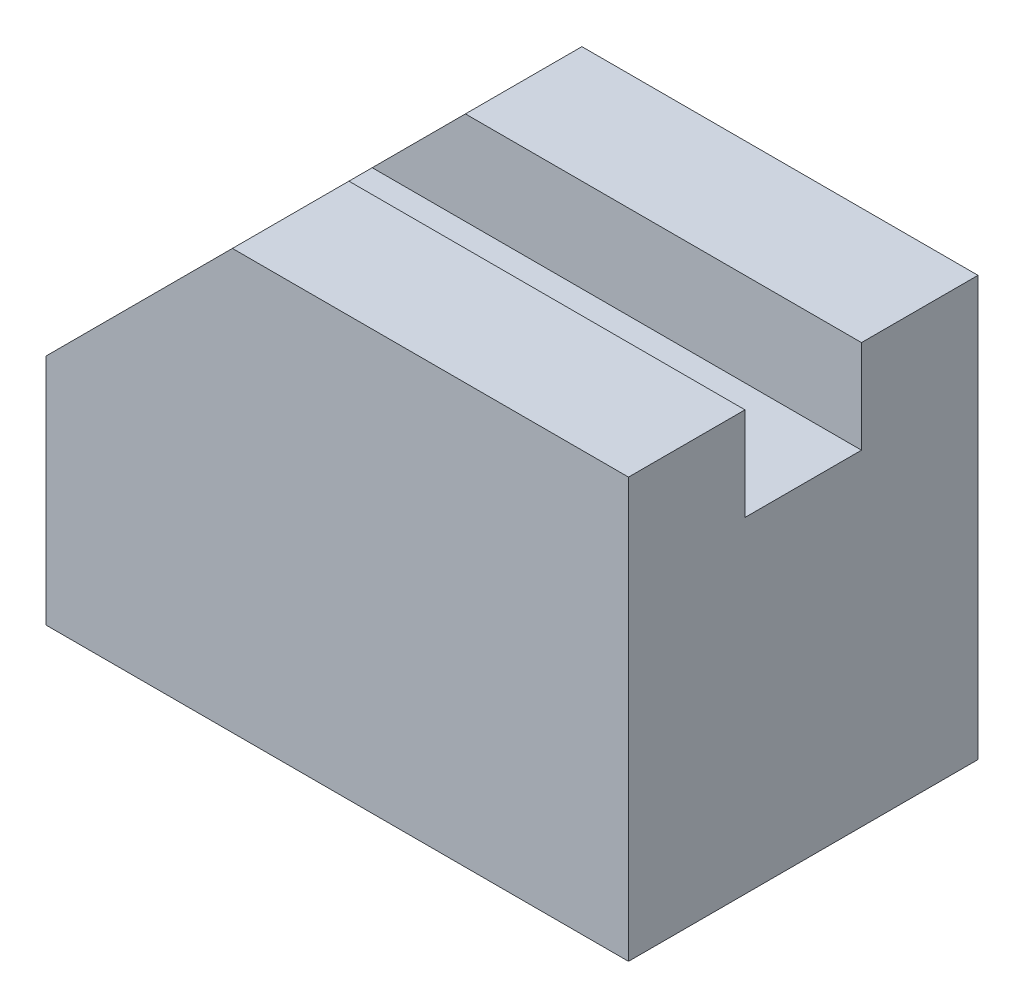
ISO-10303-21;
HEADER;
FILE_DESCRIPTION(('STEP AP214'),'2;1');
FILE_NAME('part.step','',(''),(''),'','','');
FILE_SCHEMA(('AUTOMOTIVE_DESIGN { 1 0 10303 214 1 1 1 1 }'));
ENDSEC;
DATA;
#1=APPLICATION_CONTEXT('core data for automotive mechanical design processes');
#2=APPLICATION_PROTOCOL_DEFINITION('international standard','automotive_design',2000,#1);
#3=PRODUCT_CONTEXT('',#1,'mechanical');
#4=PRODUCT('Part','Part','',(#3));
#5=PRODUCT_RELATED_PRODUCT_CATEGORY('part','',(#4));
#6=PRODUCT_DEFINITION_FORMATION('','',#4);
#7=PRODUCT_DEFINITION_CONTEXT('part definition',#1,'design');
#8=PRODUCT_DEFINITION('design','',#6,#7);
#9=PRODUCT_DEFINITION_SHAPE('','',#8);
#10=(LENGTH_UNIT() NAMED_UNIT(*) SI_UNIT(.MILLI.,.METRE.));
#11=(NAMED_UNIT(*) PLANE_ANGLE_UNIT() SI_UNIT($,.RADIAN.));
#12=(NAMED_UNIT(*) SI_UNIT($,.STERADIAN.) SOLID_ANGLE_UNIT());
#13=UNCERTAINTY_MEASURE_WITH_UNIT(LENGTH_MEASURE(1.E-05),#10,'distance_accuracy_value','');
#14=(GEOMETRIC_REPRESENTATION_CONTEXT(3) GLOBAL_UNCERTAINTY_ASSIGNED_CONTEXT((#13)) GLOBAL_UNIT_ASSIGNED_CONTEXT((#10,
#11,#12)) REPRESENTATION_CONTEXT('',''));
#15=CARTESIAN_POINT('',(0.,0.,0.));
#16=DIRECTION('',(0.,0.,1.));
#17=DIRECTION('',(1.,0.,0.));
#18=AXIS2_PLACEMENT_3D('',#15,#16,#17);
#19=CARTESIAN_POINT('',(0.,40.,30.));
#20=DIRECTION('',(1.,0.,0.));
#21=DIRECTION('',(0.,1.,0.));
#22=AXIS2_PLACEMENT_3D('',#19,#20,#21);
#23=PLANE('',#22);
#24=DIRECTION('',(0.,-1.,0.));
#25=VECTOR('',#24,1.);
#26=CARTESIAN_POINT('',(0.,40.,10.));
#27=LINE('',#26,#25);
#28=CARTESIAN_POINT('',(0.,40.,10.));
#29=VERTEX_POINT('',#28);
#30=CARTESIAN_POINT('',(0.,0.,10.));
#31=VERTEX_POINT('',#30);
#32=EDGE_CURVE('E177',#29,#31,#27,.T.);
#33=ORIENTED_EDGE('',*,*,#32,.T.);
#34=DIRECTION('',(0.,0.,-1.));
#35=VECTOR('',#34,1.);
#36=CARTESIAN_POINT('',(0.,0.,30.));
#37=LINE('',#36,#35);
#38=CARTESIAN_POINT('',(0.,0.,30.));
#39=VERTEX_POINT('',#38);
#40=EDGE_CURVE('E11',#39,#31,#37,.T.);
#41=ORIENTED_EDGE('',*,*,#40,.F.);
#42=DIRECTION('',(0.,-1.,0.));
#43=VECTOR('',#42,1.);
#44=CARTESIAN_POINT('',(0.,40.,30.));
#45=LINE('',#44,#43);
#46=CARTESIAN_POINT('',(0.,40.,30.));
#47=VERTEX_POINT('',#46);
#48=EDGE_CURVE('E138',#47,#39,#45,.T.);
#49=ORIENTED_EDGE('',*,*,#48,.F.);
#50=DIRECTION('',(0.,0.,-1.));
#51=VECTOR('',#50,1.);
#52=CARTESIAN_POINT('',(0.,40.,30.));
#53=LINE('',#52,#51);
#54=EDGE_CURVE('E139',#47,#29,#53,.T.);
#55=ORIENTED_EDGE('',*,*,#54,.T.);
#56=EDGE_LOOP('',(#33,#41,#49,#55));
#57=FACE_BOUND('',#56,.T.);
#58=ADVANCED_FACE('F31',(#57),#23,.F.);
#59=CARTESIAN_POINT('',(32.0000000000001,72.,30.));
#60=DIRECTION('',(0.707106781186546,-0.707106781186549,0.));
#61=DIRECTION('',(0.707106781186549,0.707106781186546,0.));
#62=AXIS2_PLACEMENT_3D('',#59,#60,#61);
#63=PLANE('',#62);
#64=DIRECTION('',(-0.707106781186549,-0.707106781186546,0.));
#65=VECTOR('',#64,1.);
#66=CARTESIAN_POINT('',(16.,56.,10.));
#67=LINE('',#66,#65);
#68=CARTESIAN_POINT('',(16.,56.,10.));
#69=VERTEX_POINT('',#68);
#70=EDGE_CURVE('E186',#69,#29,#67,.T.);
#71=ORIENTED_EDGE('',*,*,#70,.T.);
#72=ORIENTED_EDGE('',*,*,#54,.F.);
#73=DIRECTION('',(-0.707106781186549,-0.707106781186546,0.));
#74=VECTOR('',#73,1.);
#75=CARTESIAN_POINT('',(32.0000000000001,72.,30.));
#76=LINE('',#75,#74);
#77=CARTESIAN_POINT('',(32.0000000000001,72.,30.));
#78=VERTEX_POINT('',#77);
#79=EDGE_CURVE('E55',#78,#47,#76,.T.);
#80=ORIENTED_EDGE('',*,*,#79,.F.);
#81=DIRECTION('',(0.,0.,-1.));
#82=VECTOR('',#81,1.);
#83=CARTESIAN_POINT('',(32.0000000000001,72.,30.));
#84=LINE('',#83,#82);
#85=CARTESIAN_POINT('',(32.0000000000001,72.,10.));
#86=VERTEX_POINT('',#85);
#87=EDGE_CURVE('E120',#78,#86,#84,.T.);
#88=ORIENTED_EDGE('',*,*,#87,.T.);
#89=DIRECTION('',(-0.707106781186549,-0.707106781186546,0.));
#90=VECTOR('',#89,1.);
#91=CARTESIAN_POINT('',(32.0000000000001,72.,10.));
#92=LINE('',#91,#90);
#93=EDGE_CURVE('E201',#86,#69,#92,.T.);
#94=ORIENTED_EDGE('',*,*,#93,.T.);
#95=EDGE_LOOP('',(#71,#72,#80,#88,#94));
#96=FACE_BOUND('',#95,.T.);
#97=ADVANCED_FACE('F162',(#96),#63,.F.);
#98=CARTESIAN_POINT('',(100.,72.,30.));
#99=DIRECTION('',(0.,-1.,0.));
#100=DIRECTION('',(1.,0.,0.));
#101=AXIS2_PLACEMENT_3D('',#98,#99,#100);
#102=PLANE('',#101);
#103=DIRECTION('',(-1.,0.,0.));
#104=VECTOR('',#103,1.);
#105=CARTESIAN_POINT('',(100.,72.,10.));
#106=LINE('',#105,#104);
#107=CARTESIAN_POINT('',(100.,72.,10.));
#108=VERTEX_POINT('',#107);
#109=EDGE_CURVE('E206',#108,#86,#106,.T.);
#110=ORIENTED_EDGE('',*,*,#109,.T.);
#111=ORIENTED_EDGE('',*,*,#87,.F.);
#112=DIRECTION('',(-1.,0.,0.));
#113=VECTOR('',#112,1.);
#114=CARTESIAN_POINT('',(100.,72.,30.));
#115=LINE('',#114,#113);
#116=CARTESIAN_POINT('',(100.,72.,30.));
#117=VERTEX_POINT('',#116);
#118=EDGE_CURVE('E99',#117,#78,#115,.T.);
#119=ORIENTED_EDGE('',*,*,#118,.F.);
#120=DIRECTION('',(0.,0.,-1.));
#121=VECTOR('',#120,1.);
#122=CARTESIAN_POINT('',(100.,72.,30.));
#123=LINE('',#122,#121);
#124=EDGE_CURVE('E106',#117,#108,#123,.T.);
#125=ORIENTED_EDGE('',*,*,#124,.T.);
#126=EDGE_LOOP('',(#110,#111,#119,#125));
#127=FACE_BOUND('',#126,.T.);
#128=ADVANCED_FACE('F118',(#127),#102,.F.);
#129=CARTESIAN_POINT('',(0.,0.,-10.));
#130=VERTEX_POINT('',#129);
#131=CARTESIAN_POINT('',(0.,0.,-30.));
#132=VERTEX_POINT('',#131);
#133=EDGE_CURVE('E39',#130,#132,#37,.T.);
#134=ORIENTED_EDGE('',*,*,#133,.F.);
#135=DIRECTION('',(0.,-1.,0.));
#136=VECTOR('',#135,1.);
#137=CARTESIAN_POINT('',(0.,40.,-10.));
#138=LINE('',#137,#136);
#139=CARTESIAN_POINT('',(0.,40.,-10.));
#140=VERTEX_POINT('',#139);
#141=EDGE_CURVE('E254',#140,#130,#138,.T.);
#142=ORIENTED_EDGE('',*,*,#141,.F.);
#143=CARTESIAN_POINT('',(0.,40.,-30.));
#144=VERTEX_POINT('',#143);
#145=EDGE_CURVE('E80',#140,#144,#53,.T.);
#146=ORIENTED_EDGE('',*,*,#145,.T.);
#147=DIRECTION('',(0.,-1.,0.));
#148=VECTOR('',#147,1.);
#149=CARTESIAN_POINT('',(0.,40.,-30.));
#150=LINE('',#149,#148);
#151=EDGE_CURVE('E125',#144,#132,#150,.T.);
#152=ORIENTED_EDGE('',*,*,#151,.T.);
#153=EDGE_LOOP('',(#134,#142,#146,#152));
#154=FACE_BOUND('',#153,.T.);
#155=ADVANCED_FACE('F33',(#154),#23,.F.);
#156=CARTESIAN_POINT('',(0.,0.,30.));
#157=DIRECTION('',(0.,1.,0.));
#158=DIRECTION('',(0.,0.,1.));
#159=AXIS2_PLACEMENT_3D('',#156,#157,#158);
#160=PLANE('',#159);
#161=DIRECTION('',(0.,0.,1.));
#162=VECTOR('',#161,1.);
#163=CARTESIAN_POINT('',(16.,0.,-10.));
#164=LINE('',#163,#162);
#165=CARTESIAN_POINT('',(16.,0.,-10.));
#166=VERTEX_POINT('',#165);
#167=CARTESIAN_POINT('',(16.,0.,10.));
#168=VERTEX_POINT('',#167);
#169=EDGE_CURVE('E190',#166,#168,#164,.T.);
#170=ORIENTED_EDGE('',*,*,#169,.F.);
#171=DIRECTION('',(1.,0.,0.));
#172=VECTOR('',#171,1.);
#173=CARTESIAN_POINT('',(0.,0.,-10.));
#174=LINE('',#173,#172);
#175=EDGE_CURVE('E151',#130,#166,#174,.T.);
#176=ORIENTED_EDGE('',*,*,#175,.F.);
#177=ORIENTED_EDGE('',*,*,#133,.T.);
#178=DIRECTION('',(1.,0.,0.));
#179=VECTOR('',#178,1.);
#180=CARTESIAN_POINT('',(0.,0.,-30.));
#181=LINE('',#180,#179);
#182=CARTESIAN_POINT('',(100.,0.,-30.));
#183=VERTEX_POINT('',#182);
#184=EDGE_CURVE('E127',#132,#183,#181,.T.);
#185=ORIENTED_EDGE('',*,*,#184,.T.);
#186=DIRECTION('',(0.,0.,-1.));
#187=VECTOR('',#186,1.);
#188=CARTESIAN_POINT('',(100.,0.,30.));
#189=LINE('',#188,#187);
#190=CARTESIAN_POINT('',(100.,0.,30.));
#191=VERTEX_POINT('',#190);
#192=EDGE_CURVE('E115',#191,#183,#189,.T.);
#193=ORIENTED_EDGE('',*,*,#192,.F.);
#194=DIRECTION('',(1.,0.,0.));
#195=VECTOR('',#194,1.);
#196=CARTESIAN_POINT('',(0.,0.,30.));
#197=LINE('',#196,#195);
#198=EDGE_CURVE('E88',#39,#191,#197,.T.);
#199=ORIENTED_EDGE('',*,*,#198,.F.);
#200=ORIENTED_EDGE('',*,*,#40,.T.);
#201=DIRECTION('',(1.,0.,0.));
#202=VECTOR('',#201,1.);
#203=CARTESIAN_POINT('',(0.,0.,10.));
#204=LINE('',#203,#202);
#205=EDGE_CURVE('E185',#31,#168,#204,.T.);
#206=ORIENTED_EDGE('',*,*,#205,.T.);
#207=EDGE_LOOP('',(#170,#176,#177,#185,#193,#199,#200,#206));
#208=FACE_BOUND('',#207,.T.);
#209=ADVANCED_FACE('F148',(#208),#160,.F.);
#210=CARTESIAN_POINT('',(100.,0.,30.));
#211=DIRECTION('',(-1.,0.,0.));
#212=DIRECTION('',(0.,0.,1.));
#213=AXIS2_PLACEMENT_3D('',#210,#211,#212);
#214=PLANE('',#213);
#215=CARTESIAN_POINT('',(100.,72.,-10.));
#216=VERTEX_POINT('',#215);
#217=CARTESIAN_POINT('',(100.,72.,-30.));
#218=VERTEX_POINT('',#217);
#219=EDGE_CURVE('E116',#216,#218,#123,.T.);
#220=ORIENTED_EDGE('',*,*,#219,.F.);
#221=DIRECTION('',(0.,1.,0.));
#222=VECTOR('',#221,1.);
#223=CARTESIAN_POINT('',(100.,56.,-10.));
#224=LINE('',#223,#222);
#225=CARTESIAN_POINT('',(100.,56.,-10.));
#226=VERTEX_POINT('',#225);
#227=EDGE_CURVE('E209',#226,#216,#224,.T.);
#228=ORIENTED_EDGE('',*,*,#227,.F.);
#229=DIRECTION('',(0.,0.,1.));
#230=VECTOR('',#229,1.);
#231=CARTESIAN_POINT('',(100.,56.,-10.));
#232=LINE('',#231,#230);
#233=CARTESIAN_POINT('',(100.,56.,10.));
#234=VERTEX_POINT('',#233);
#235=EDGE_CURVE('E128',#226,#234,#232,.T.);
#236=ORIENTED_EDGE('',*,*,#235,.T.);
#237=DIRECTION('',(0.,1.,0.));
#238=VECTOR('',#237,1.);
#239=CARTESIAN_POINT('',(100.,56.,10.));
#240=LINE('',#239,#238);
#241=EDGE_CURVE('E112',#234,#108,#240,.T.);
#242=ORIENTED_EDGE('',*,*,#241,.T.);
#243=ORIENTED_EDGE('',*,*,#124,.F.);
#244=DIRECTION('',(0.,1.,0.));
#245=VECTOR('',#244,1.);
#246=CARTESIAN_POINT('',(100.,0.,30.));
#247=LINE('',#246,#245);
#248=EDGE_CURVE('E95',#191,#117,#247,.T.);
#249=ORIENTED_EDGE('',*,*,#248,.F.);
#250=ORIENTED_EDGE('',*,*,#192,.T.);
#251=DIRECTION('',(0.,1.,0.));
#252=VECTOR('',#251,1.);
#253=CARTESIAN_POINT('',(100.,0.,-30.));
#254=LINE('',#253,#252);
#255=EDGE_CURVE('E130',#183,#218,#254,.T.);
#256=ORIENTED_EDGE('',*,*,#255,.T.);
#257=EDGE_LOOP('',(#220,#228,#236,#242,#243,#249,#250,#256));
#258=FACE_BOUND('',#257,.T.);
#259=ADVANCED_FACE('F108',(#258),#214,.F.);
#260=CARTESIAN_POINT('',(32.0000000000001,72.,-10.));
#261=VERTEX_POINT('',#260);
#262=CARTESIAN_POINT('',(32.0000000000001,72.,-30.));
#263=VERTEX_POINT('',#262);
#264=EDGE_CURVE('E142',#261,#263,#84,.T.);
#265=ORIENTED_EDGE('',*,*,#264,.F.);
#266=DIRECTION('',(-1.,0.,0.));
#267=VECTOR('',#266,1.);
#268=CARTESIAN_POINT('',(100.,72.,-10.));
#269=LINE('',#268,#267);
#270=EDGE_CURVE('E212',#216,#261,#269,.T.);
#271=ORIENTED_EDGE('',*,*,#270,.F.);
#272=ORIENTED_EDGE('',*,*,#219,.T.);
#273=DIRECTION('',(-1.,0.,0.));
#274=VECTOR('',#273,1.);
#275=CARTESIAN_POINT('',(100.,72.,-30.));
#276=LINE('',#275,#274);
#277=EDGE_CURVE('E133',#218,#263,#276,.T.);
#278=ORIENTED_EDGE('',*,*,#277,.T.);
#279=EDGE_LOOP('',(#265,#271,#272,#278));
#280=FACE_BOUND('',#279,.T.);
#281=ADVANCED_FACE('F164',(#280),#102,.F.);
#282=ORIENTED_EDGE('',*,*,#145,.F.);
#283=DIRECTION('',(-0.707106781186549,-0.707106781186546,0.));
#284=VECTOR('',#283,1.);
#285=CARTESIAN_POINT('',(16.,56.,-10.));
#286=LINE('',#285,#284);
#287=CARTESIAN_POINT('',(16.,56.,-10.));
#288=VERTEX_POINT('',#287);
#289=EDGE_CURVE('E196',#288,#140,#286,.T.);
#290=ORIENTED_EDGE('',*,*,#289,.F.);
#291=DIRECTION('',(-0.707106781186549,-0.707106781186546,0.));
#292=VECTOR('',#291,1.);
#293=CARTESIAN_POINT('',(32.0000000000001,72.,-10.));
#294=LINE('',#293,#292);
#295=EDGE_CURVE('E202',#261,#288,#294,.T.);
#296=ORIENTED_EDGE('',*,*,#295,.F.);
#297=ORIENTED_EDGE('',*,*,#264,.T.);
#298=DIRECTION('',(-0.707106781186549,-0.707106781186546,0.));
#299=VECTOR('',#298,1.);
#300=CARTESIAN_POINT('',(32.0000000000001,72.,-30.));
#301=LINE('',#300,#299);
#302=EDGE_CURVE('E136',#263,#144,#301,.T.);
#303=ORIENTED_EDGE('',*,*,#302,.T.);
#304=EDGE_LOOP('',(#282,#290,#296,#297,#303));
#305=FACE_BOUND('',#304,.T.);
#306=ADVANCED_FACE('F172',(#305),#63,.F.);
#307=CARTESIAN_POINT('',(0.,0.,30.));
#308=DIRECTION('',(0.,0.,1.));
#309=DIRECTION('',(1.,0.,0.));
#310=AXIS2_PLACEMENT_3D('',#307,#308,#309);
#311=PLANE('',#310);
#312=ORIENTED_EDGE('',*,*,#48,.T.);
#313=ORIENTED_EDGE('',*,*,#198,.T.);
#314=ORIENTED_EDGE('',*,*,#248,.T.);
#315=ORIENTED_EDGE('',*,*,#118,.T.);
#316=ORIENTED_EDGE('',*,*,#79,.T.);
#317=EDGE_LOOP('',(#312,#313,#314,#315,#316));
#318=FACE_BOUND('',#317,.T.);
#319=ADVANCED_FACE('F97',(#318),#311,.T.);
#320=CARTESIAN_POINT('',(0.,0.,-30.));
#321=DIRECTION('',(0.,0.,1.));
#322=DIRECTION('',(1.,0.,0.));
#323=AXIS2_PLACEMENT_3D('',#320,#321,#322);
#324=PLANE('',#323);
#325=ORIENTED_EDGE('',*,*,#151,.F.);
#326=ORIENTED_EDGE('',*,*,#302,.F.);
#327=ORIENTED_EDGE('',*,*,#277,.F.);
#328=ORIENTED_EDGE('',*,*,#255,.F.);
#329=ORIENTED_EDGE('',*,*,#184,.F.);
#330=EDGE_LOOP('',(#325,#326,#327,#328,#329));
#331=FACE_BOUND('',#330,.T.);
#332=ADVANCED_FACE('F154',(#331),#324,.F.);
#333=CARTESIAN_POINT('',(16.,56.,-10.));
#334=DIRECTION('',(0.,-1.,0.));
#335=DIRECTION('',(0.,0.,-1.));
#336=AXIS2_PLACEMENT_3D('',#333,#334,#335);
#337=PLANE('',#336);
#338=DIRECTION('',(1.,0.,0.));
#339=VECTOR('',#338,1.);
#340=CARTESIAN_POINT('',(16.,56.,10.));
#341=LINE('',#340,#339);
#342=EDGE_CURVE('E218',#69,#234,#341,.T.);
#343=ORIENTED_EDGE('',*,*,#342,.T.);
#344=ORIENTED_EDGE('',*,*,#235,.F.);
#345=DIRECTION('',(1.,0.,0.));
#346=VECTOR('',#345,1.);
#347=CARTESIAN_POINT('',(16.,56.,-10.));
#348=LINE('',#347,#346);
#349=EDGE_CURVE('E205',#288,#226,#348,.T.);
#350=ORIENTED_EDGE('',*,*,#349,.F.);
#351=DIRECTION('',(0.,0.,1.));
#352=VECTOR('',#351,1.);
#353=CARTESIAN_POINT('',(16.,56.,-10.));
#354=LINE('',#353,#352);
#355=EDGE_CURVE('E215',#288,#69,#354,.T.);
#356=ORIENTED_EDGE('',*,*,#355,.T.);
#357=EDGE_LOOP('',(#343,#344,#350,#356));
#358=FACE_BOUND('',#357,.T.);
#359=ADVANCED_FACE('F228',(#358),#337,.F.);
#360=CARTESIAN_POINT('',(100.,140.,-10.));
#361=DIRECTION('',(0.,0.,-1.));
#362=DIRECTION('',(-1.,0.,0.));
#363=AXIS2_PLACEMENT_3D('',#360,#361,#362);
#364=PLANE('',#363);
#365=ORIENTED_EDGE('',*,*,#295,.T.);
#366=ORIENTED_EDGE('',*,*,#349,.T.);
#367=ORIENTED_EDGE('',*,*,#227,.T.);
#368=ORIENTED_EDGE('',*,*,#270,.T.);
#369=EDGE_LOOP('',(#365,#366,#367,#368));
#370=FACE_BOUND('',#369,.T.);
#371=ADVANCED_FACE('F264',(#370),#364,.F.);
#372=CARTESIAN_POINT('',(100.,140.,10.));
#373=DIRECTION('',(0.,0.,-1.));
#374=DIRECTION('',(-1.,0.,0.));
#375=AXIS2_PLACEMENT_3D('',#372,#373,#374);
#376=PLANE('',#375);
#377=ORIENTED_EDGE('',*,*,#93,.F.);
#378=ORIENTED_EDGE('',*,*,#109,.F.);
#379=ORIENTED_EDGE('',*,*,#241,.F.);
#380=ORIENTED_EDGE('',*,*,#342,.F.);
#381=EDGE_LOOP('',(#377,#378,#379,#380));
#382=FACE_BOUND('',#381,.T.);
#383=ADVANCED_FACE('F236',(#382),#376,.T.);
#384=CARTESIAN_POINT('',(16.,0.,-10.));
#385=DIRECTION('',(1.,0.,0.));
#386=DIRECTION('',(0.,0.,-1.));
#387=AXIS2_PLACEMENT_3D('',#384,#385,#386);
#388=PLANE('',#387);
#389=DIRECTION('',(0.,1.,0.));
#390=VECTOR('',#389,1.);
#391=CARTESIAN_POINT('',(16.,0.,10.));
#392=LINE('',#391,#390);
#393=EDGE_CURVE('E46',#168,#69,#392,.T.);
#394=ORIENTED_EDGE('',*,*,#393,.T.);
#395=ORIENTED_EDGE('',*,*,#355,.F.);
#396=DIRECTION('',(0.,1.,0.));
#397=VECTOR('',#396,1.);
#398=CARTESIAN_POINT('',(16.,0.,-10.));
#399=LINE('',#398,#397);
#400=EDGE_CURVE('E193',#166,#288,#399,.T.);
#401=ORIENTED_EDGE('',*,*,#400,.F.);
#402=ORIENTED_EDGE('',*,*,#169,.T.);
#403=EDGE_LOOP('',(#394,#395,#401,#402));
#404=FACE_BOUND('',#403,.T.);
#405=ADVANCED_FACE('F271',(#404),#388,.F.);
#406=CARTESIAN_POINT('',(16.,0.,-10.));
#407=DIRECTION('',(0.,0.,-1.));
#408=DIRECTION('',(-1.,0.,0.));
#409=AXIS2_PLACEMENT_3D('',#406,#407,#408);
#410=PLANE('',#409);
#411=ORIENTED_EDGE('',*,*,#400,.T.);
#412=ORIENTED_EDGE('',*,*,#289,.T.);
#413=ORIENTED_EDGE('',*,*,#141,.T.);
#414=ORIENTED_EDGE('',*,*,#175,.T.);
#415=EDGE_LOOP('',(#411,#412,#413,#414));
#416=FACE_BOUND('',#415,.T.);
#417=ADVANCED_FACE('F253',(#416),#410,.F.);
#418=CARTESIAN_POINT('',(16.,0.,10.));
#419=DIRECTION('',(0.,0.,-1.));
#420=DIRECTION('',(-1.,0.,0.));
#421=AXIS2_PLACEMENT_3D('',#418,#419,#420);
#422=PLANE('',#421);
#423=ORIENTED_EDGE('',*,*,#393,.F.);
#424=ORIENTED_EDGE('',*,*,#205,.F.);
#425=ORIENTED_EDGE('',*,*,#32,.F.);
#426=ORIENTED_EDGE('',*,*,#70,.F.);
#427=EDGE_LOOP('',(#423,#424,#425,#426));
#428=FACE_BOUND('',#427,.T.);
#429=ADVANCED_FACE('F338',(#428),#422,.T.);
#430=CLOSED_SHELL('',(#58,#97,#128,#155,#209,#259,#281,#306,#319,#332,#359,#371,#383,#405,#417,#429));
#431=MANIFOLD_SOLID_BREP('B2',#430);
#432=ADVANCED_BREP_SHAPE_REPRESENTATION('',(#18,#431),#14);
#433=SHAPE_DEFINITION_REPRESENTATION(#9,#432);
ENDSEC;
END-ISO-10303-21;
